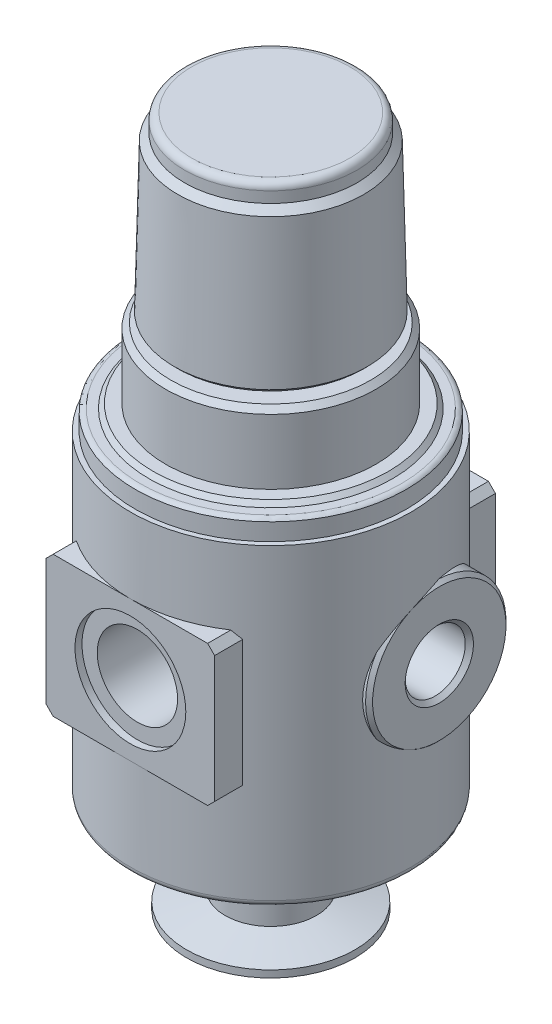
from build123d import *

# Parameters (mm, degrees)
EXTRUDE_1_DEPTH      = 20
EXTRUDE_1_DEPTH_BACK = 20


with BuildPart() as part:
    # Sketch 1 → Revolve 1 (revolve)
    with BuildSketch(Plane.XY, mode=Mode.PRIVATE) as revolve_1_sk:
        with BuildLine():
            Line((0, -14.3), (-12, -14.3))
            Line((-12, -14.3), (-12, -13.3))
            Line((-12, -13.3), (-6.5, -11.826279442))
            Line((-6.5, -11.826279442), (-6.5, 0))
            Line((-6.5, 0), (-12, 0))
            Line((-12, 0), (-12, 1))
            Line((-12, 1), (-6.5, 2.473720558))
            Line((-6.5, 2.473720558), (-6.5, 5.7))
            Line((-6.5, 5.7), (-18, 5.7))
            Line((-18, 5.7), (-18, 0))
            Line((-18, 0), (-19.1, 0))
            ThreePointArc((-19.1, 0), (-19.736396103, 0.263603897), (-20, 0.9))
            Line((-20, 0.9), (-20, 44.7))
            Line((-20, 44.7), (-19.31, 44.7))
            Line((-19.31, 44.7), (-19.31, 47.15))
            ThreePointArc((-19.31, 47.15), (-18.994472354, 47.407774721), (-18.597609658, 47.5))
            Line((-18.597609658, 47.5), (-17.3625, 47.5))
            Line((-17.3625, 47.5), (-16.7625, 48.1))
            Line((-16.7625, 48.1), (-15, 48.1))
            Line((-15, 48.1), (-15, 57.35))
            Line((-15, 57.35), (-14.25, 58.1))
            Line((-14.25, 58.1), (-11.5, 58.1))
            Line((-11.5, 58.1), (-11.5, 59))
            Line((-11.5, 59), (-13.25, 59))
            Line((-13.25, 59), (-13.738375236, 59.499864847))
            Line((-13.738375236, 59.499864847), (-13.25, 80.5))
            Line((-13.25, 80.5), (-12.2727, 81.44))
            Line((-12.2727, 81.44), (-12.2727, 83))
            ThreePointArc((-12.2727, 83), (-11.979806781, 83.707106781), (-11.2727, 84))
            Line((-11.2727, 84), (0, 84))
            Line((0, 84), (0, -14.3))
        make_face()
    revolve(revolve_1_sk.sketch.rotate(Axis((0, 84, 0), (0, -1, 0)), 180), axis=Axis((0, 84, 0), (0, -1, 0)))

    # Sketch 2 → Revolve 2 (revolve)
    with BuildSketch(Plane.XY.offset(-4)):
        Polygon((-20, 24), (-20, 33.5), (-19.5, 34), (19.5, 34), (20, 33.5), (20, 24), align=None)
    revolve(axis=Axis((20, 24, -4), (-1, 0, 0)))

    # Sketch 3 → Extrude 1 (add, two sides: drawn at the far end of the back side and taken through both)
    with BuildSketch(Plane.XY.offset(-EXTRUDE_1_DEPTH_BACK)):
        Polygon((-12, 33), (-12, 15), (-11, 14), (11, 14), (12, 15), (12, 33), (11, 34), (-11, 34), align=None)
    extrude(amount=EXTRUDE_1_DEPTH + EXTRUDE_1_DEPTH_BACK)

    # Sketch 4 → Cut-Revolve 1 (revolve, cut)
    with BuildSketch(Plane(origin=(0, 0, 0), x_dir=(0, 0, -1), z_dir=(1, 0, 0)), mode=Mode.PRIVATE) as cut_revolve_1_sk:
        Polygon((5, 24), (5, 29.7225), (19, 29.7225), (19, 31.8942), (20, 31.8942), (20, 24), align=None)
    revolve(cut_revolve_1_sk.sketch.rotate(Axis((0, 24, -20), (0, 0, 1)), 270), axis=Axis((0, 24, -20), (0, 0, 1)), mode=Mode.SUBTRACT)

    # Sketch 5 → Cut-Revolve 2 (revolve, cut)
    with BuildSketch(Plane(origin=(0, 0, 0), x_dir=(0, 0, -1), z_dir=(1, 0, 0)), mode=Mode.PRIVATE) as cut_revolve_2_sk:
        Polygon((-20, 24), (-20, 31.8942), (-19, 31.8942), (-19, 29.7225), (-5, 29.7225), (-5, 24), align=None)
    revolve(cut_revolve_2_sk.sketch.rotate(Axis((0, 24, 5), (0, 0, 1)), 270), axis=Axis((0, 24, 5), (0, 0, 1)), mode=Mode.SUBTRACT)

    # Sketch 6 → Cut-Revolve 3 (revolve, cut)
    with BuildSketch(Plane.XY.offset(-4), mode=Mode.PRIVATE) as cut_revolve_3_sk:
        Polygon((-20, 24), (-20, 28.864), (-19.419, 28.283), (-8, 28.283), (-8, 24), align=None)
    revolve(cut_revolve_3_sk.sketch.rotate(Axis((-8, 24, -4), (-1, 0, 0)), 270), axis=Axis((-8, 24, -4), (-1, 0, 0)), mode=Mode.SUBTRACT)

    # Sketch 7 → Cut-Revolve 4 (revolve, cut)
    with BuildSketch(Plane.XY.offset(-4), mode=Mode.PRIVATE) as cut_revolve_4_sk:
        Polygon((8, 24), (8, 28.283), (19.419, 28.283), (20, 28.864), (20, 24), align=None)
    revolve(cut_revolve_4_sk.sketch.rotate(Axis((20, 24, -4), (-1, 0, 0)), 270), axis=Axis((20, 24, -4), (-1, 0, 0)), mode=Mode.SUBTRACT)


solid = part.part
